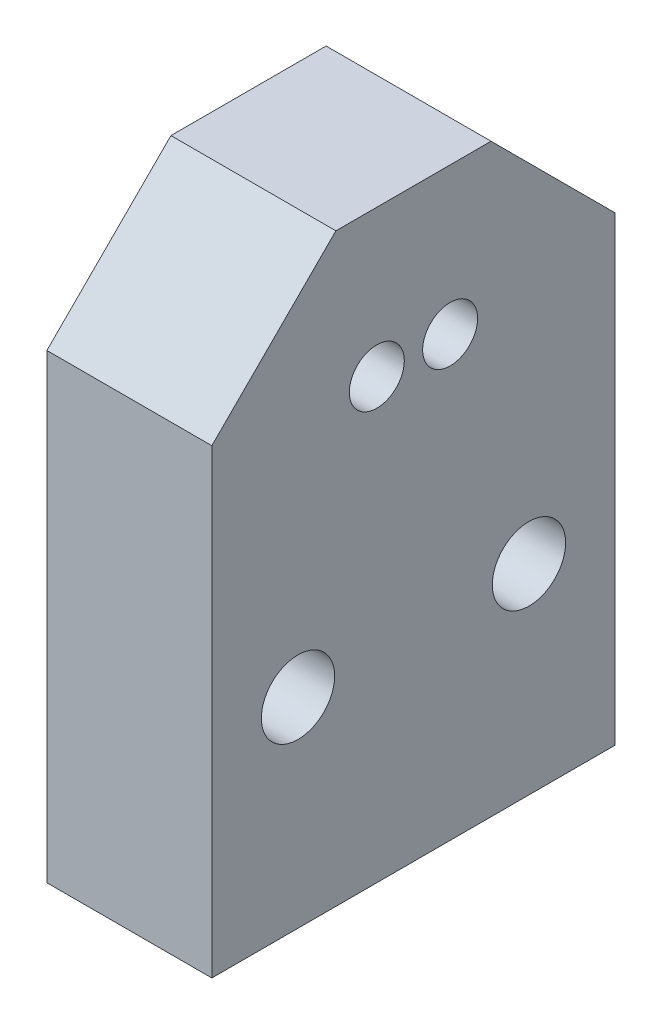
from build123d import *

# Parameters (mm, degrees)
BOSS_EXTRUDE1_DEPTH = 9
SKETCH2_R           = 2
SKETCH2_R_2         = 1.5
CUT_EXTRUDE2_DEPTH  = 50.700143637
CUT_EXTRUDE3_DEPTH  = 50.700143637


with BuildPart() as part:
    # Sketch1 → Boss-Extrude1 (new body)
    with BuildSketch(Plane(origin=(0, 0, 0), x_dir=(0, 0, -1), z_dir=(1, 0, 0))):
        Polygon((-19.081516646, 35.771524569), (-9.853041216, 45), (-1.386641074, 45), (7.841834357, 35.771524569), (7.841834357, 13.079888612), (-19.081516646, 13.079888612), align=None)
    extrude(amount=BOSS_EXTRUDE1_DEPTH)

    # Sketch2 → Cut-Extrude2 (cut, through all)
    with BuildSketch(Plane(origin=(9, 0, 0), x_dir=(0, 0, -1), z_dir=(1, 0, 0))):
        with Locations((0.680158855, 24)):
            Circle(SKETCH2_R)
        with Locations((-7.619841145, 37)):
            Circle(SKETCH2_R_2)
        with Locations((-3.619841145, 37)):
            Circle(SKETCH2_R_2)
        with Locations((-11.919841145, 24)):
            Circle(SKETCH2_R)
    extrude(amount=-CUT_EXTRUDE2_DEPTH, mode=Mode.SUBTRACT)

    # Sketch4 → Cut-Extrude3 (cut, through all)
    with BuildSketch(Plane(origin=(9, 0, 0), x_dir=(0, 0, -1), z_dir=(1, 0, 0))):
        Polygon((-16.621516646, 38.231524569), (-16.621516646, 13.079888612), (-16.621516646, 12.745169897), (-21.874431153, 12.745169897), (-21.874431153, 38.231524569), align=None)
        Polygon((5.381834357, 38.231524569), (5.381834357, 13.079888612), (5.381834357, 12.383510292), (11.960834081, 12.383510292), (11.960834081, 38.231524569), align=None)
    extrude(amount=-CUT_EXTRUDE3_DEPTH, mode=Mode.SUBTRACT)


solid = part.part
